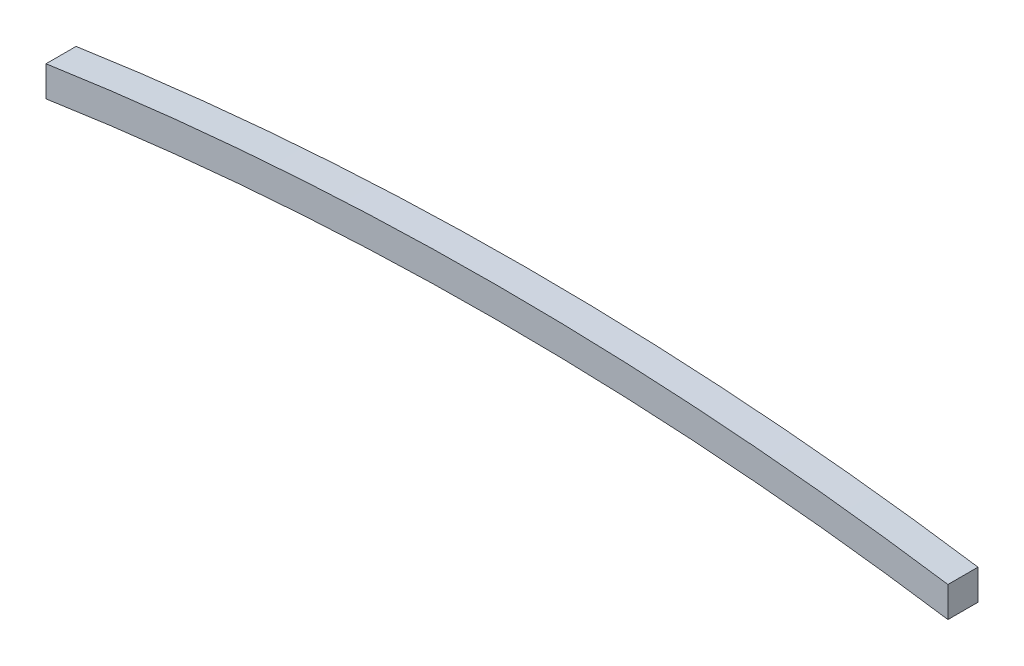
from build123d import *

# Parameters (mm, degrees)
LINEAR_AUSTRAGEN1_DEPTH = 50


with BuildPart() as part:
    # Skizze1 → Linear austragen1 (new body)
    with BuildSketch(Plane.XY):
        with BuildLine():
            Line((0, 0), (0, 50.566412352))
            ThreePointArc((0, 50.566412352), (750, 106.570016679), (1500, 50.566412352))
            Line((1500, 50.566412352), (1500, 0))
            ThreePointArc((1500, 0), (750, 56.570016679), (0, 0))
        make_face()
    extrude(amount=-LINEAR_AUSTRAGEN1_DEPTH)


solid = part.part
